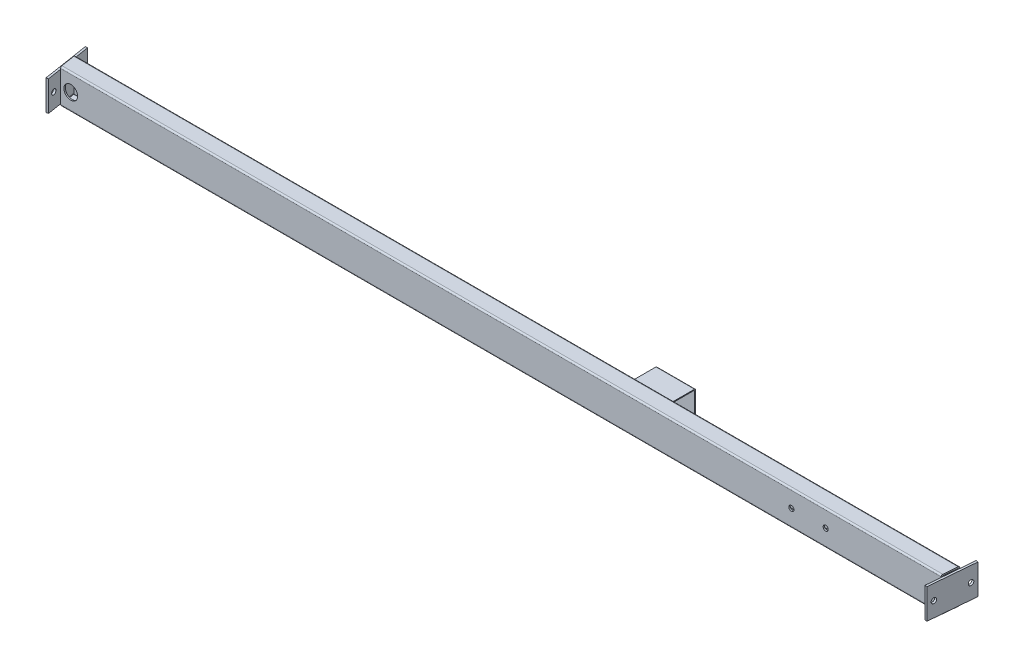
from build123d import *

# Parameters (mm, degrees)
EL_MENT_M_CANO_SOUD_1_DEPTH = 2065
ESQUISSE2_W                 = 99.847787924
ESQUISSE2_H                 = 140
ENL_V_MAT_EXTRU_1_DEPTH     = 10
ESQUISSE3_W                 = 99.507533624
ESQUISSE3_H                 = 140
ENL_V_MAT_EXTRU_3_DEPTH     = 208
ESQUISSE4_W                 = 110
ESQUISSE4_H                 = 70
ESQUISSE4_R                 = 6
BOSS_EXTRU_1_DEPTH          = 5
ESQUISSE5_W                 = 110
ESQUISSE5_H                 = 70
ESQUISSE5_R                 = 6
BOSS_EXTRU_2_DEPTH          = 5
ESQUISSE6_R                 = 6
ESQUISSE6_R_2               = 16
ENL_V_MAT_EXTRU_4_DEPTH     = 2075.782634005
EL_MENT_M_CANO_SOUD_2_DEPTH = 90
ESQUISSE9_R                 = 10
ENL_V_MAT_EXTRU_5_DEPTH     = 2
ESQUISSE10_R                = 8
BOSS_EXTRU_3_DEPTH          = 15


with BuildPart() as part:
    # Sketch1 → El_ment m_cano-soud_1 (new body)
    with BuildSketch(Plane(origin=(0, 0, 0), x_dir=(0, 0, -1), z_dir=(1, 0, 0))):
        with BuildLine():
            Line((-16.5, -40), (16.5, -40))
            ThreePointArc((16.5, -40), (18.974873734, -38.974873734), (20, -36.5))
            Line((20, -36.5), (20, 36.5))
            ThreePointArc((20, 36.5), (18.974873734, 38.974873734), (16.5, 40))
            Line((16.5, 40), (-16.5, 40))
            ThreePointArc((-16.5, 40), (-18.974873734, 38.974873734), (-20, 36.5))
            Line((-20, 36.5), (-20, -36.5))
            ThreePointArc((-20, -36.5), (-18.974873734, -38.974873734), (-16.5, -40))
        make_face()
        with BuildLine():
            Line((-16.5, -36.8), (16.5, -36.8))
            ThreePointArc((16.5, -36.8), (16.712132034, -36.712132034), (16.8, -36.5))
            Line((16.8, -36.5), (16.8, 36.5))
            ThreePointArc((16.8, 36.5), (16.712132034, 36.712132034), (16.5, 36.8))
            Line((16.5, 36.8), (-16.5, 36.8))
            ThreePointArc((-16.5, 36.8), (-16.712132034, 36.712132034), (-16.8, 36.5))
            Line((-16.8, 36.5), (-16.8, -36.5))
            ThreePointArc((-16.8, -36.5), (-16.712132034, -36.712132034), (-16.5, -36.8))
        make_face(mode=Mode.SUBTRACT)
    extrude(amount=EL_MENT_M_CANO_SOUD_1_DEPTH)

    # Esquisse2 → Enl_v. mat.-Extru.1 (cut)
    with BuildSketch(Plane(origin=(2047.577523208, 0, 179.139820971), x_dir=(0.08715574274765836, 0, -0.9961946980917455), z_dir=(0.9961946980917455, 0, 0.08715574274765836))):
        with Locations((179.976608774, 0)):
            Rectangle(ESQUISSE2_W, ESQUISSE2_H)
    extrude(amount=ENL_V_MAT_EXTRU_1_DEPTH, mode=Mode.SUBTRACT)

    # Esquisse3 → Enl_v. mat.-Extru.3 (cut)
    with BuildSketch(Plane(origin=(3.090169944, 0, -0.489434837), x_dir=(0.15643446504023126, 0, 0.9876883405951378), z_dir=(-0.9876883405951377, 0, 0.15643446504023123))):
        Rectangle(ESQUISSE3_W, ESQUISSE3_H)
    extrude(amount=ENL_V_MAT_EXTRU_3_DEPTH, mode=Mode.SUBTRACT)

    # Esquisse6 → Enl_v. mat.-Extru.4 (cut, through all)
    with BuildSketch(Plane(origin=(0, 0, -20), x_dir=(-1, 0, 0), z_dir=(0, 0, -1))):
        with Locations((-1792, 0)):
            Circle(ESQUISSE6_R)
        with Locations((-1712, 0)):
            Circle(ESQUISSE6_R)
        with Locations((-30, 0)):
            Circle(ESQUISSE6_R_2)
    extrude(amount=-ENL_V_MAT_EXTRU_4_DEPTH, mode=Mode.SUBTRACT)


with BuildPart() as body_2:
    # Esquisse4 → Boss.-Extru.1 (new body)
    with BuildSketch(Plane(origin=(3.090169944, 0, -0.489434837), x_dir=(0.15643446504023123, 0, 0.9876883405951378), z_dir=(-0.9876883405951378, 0, 0.15643446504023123))):
        Rectangle(ESQUISSE4_W, ESQUISSE4_H)
        with Locations((-40, 0)):
            Circle(ESQUISSE4_R, mode=Mode.SUBTRACT)
        with Locations((40, 0)):
            Circle(ESQUISSE4_R, mode=Mode.SUBTRACT)
    extrude(amount=BOSS_EXTRU_1_DEPTH)


with BuildPart() as body_3:
    # Esquisse5 → Boss.-Extru.2 (new body)
    with BuildSketch(Plane(origin=(2047.577523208, 0, 179.139820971), x_dir=(0.08715574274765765, 0, -0.9961946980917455), z_dir=(0.9961946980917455, 0, 0.08715574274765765))):
        with Locations((179.976608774, 0)):
            Rectangle(ESQUISSE5_W, ESQUISSE5_H)
        with Locations((219.976608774, 0)):
            Circle(ESQUISSE5_R, mode=Mode.SUBTRACT)
        with Locations((139.976608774, 0)):
            Circle(ESQUISSE5_R, mode=Mode.SUBTRACT)
    extrude(amount=BOSS_EXTRU_2_DEPTH)


with BuildPart() as body_4:
    # Sketch12 → El_ment m_cano-soud_2 (new body)
    with BuildSketch(Plane(origin=(1298, 0, -50), x_dir=(0, 0, -1), z_dir=(1, 0, 0))):
        with BuildLine():
            Line((-27.8, -30), (27.8, -30))
            ThreePointArc((27.8, -30), (29.355634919, -29.355634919), (30, -27.8))
            Line((30, -27.8), (30, 27.8))
            ThreePointArc((30, 27.8), (29.355634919, 29.355634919), (27.8, 30))
            Line((27.8, 30), (-27.8, 30))
            ThreePointArc((-27.8, 30), (-29.355634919, 29.355634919), (-30, 27.8))
            Line((-30, 27.8), (-30, -27.8))
            ThreePointArc((-30, -27.8), (-29.355634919, -29.355634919), (-27.8, -30))
        make_face()
        with BuildLine():
            Line((-27.8, -28), (27.8, -28))
            ThreePointArc((27.8, -28), (27.941421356, -27.941421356), (28, -27.8))
            Line((28, -27.8), (28, 27.8))
            ThreePointArc((28, 27.8), (27.941421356, 27.941421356), (27.8, 28))
            Line((27.8, 28), (-27.8, 28))
            ThreePointArc((-27.8, 28), (-27.941421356, 27.941421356), (-28, 27.8))
            Line((-28, 27.8), (-28, -27.8))
            ThreePointArc((-28, -27.8), (-27.941421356, -27.941421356), (-27.8, -28))
        make_face(mode=Mode.SUBTRACT)
    extrude(amount=EL_MENT_M_CANO_SOUD_2_DEPTH)

    # Esquisse9 → Enl_v. mat.-Extru.5 (cut)
    with BuildSketch(Plane.XZ.offset(30)):
        with Locations(Location((1343, -50, 0), (0, 0, 270))):
            Circle(ESQUISSE9_R)
    extrude(amount=-ENL_V_MAT_EXTRU_5_DEPTH, mode=Mode.SUBTRACT)


with BuildPart() as body_5:
    # Esquisse10 → Boss.-Extru.3 (new body)
    with BuildSketch(Plane.XZ.offset(30)):
        Polygon((1333, -44.226497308), (1333, -55.773502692), (1343, -61.547005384), (1353, -55.773502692), (1353, -44.226497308), (1343, -38.452994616), align=None)
        with Locations(Location((1343, -50, 0), (0, 0, 270))):
            Circle(ESQUISSE10_R, mode=Mode.SUBTRACT)
    extrude(amount=BOSS_EXTRU_3_DEPTH)


solid = Compound([part.part, body_2.part, body_3.part, body_4.part, body_5.part])
